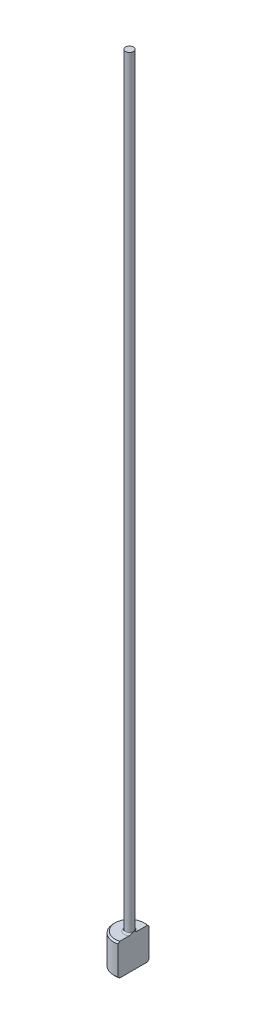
from build123d import *
from build123d.topology import SkipClean

# Parameters (mm, degrees)
CHAMFER1_SIZE    = 0.2
FILLET1_R        = 0.2
KEYED_HEAD_DEPTH = 101.039992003


with BuildPart() as part:
    # Sketch1 → Revolve1 (revolve)
    with BuildSketch(Plane.XY, mode=Mode.PRIVATE) as revolve1_sk:
        Polygon((0, 0), (-2, 0), (-2, 4), (-0.5, 4), (-0.5, 100), (0, 100), align=None)
    revolve(revolve1_sk.sketch.rotate(Axis((0, 259.958771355, 0), (0, -1, 0)), 270), axis=Axis((0, 259.958771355, 0), (0, -1, 0)))

    # Chamfer1
    chamfer1_edges = [part.edges().sort_by_distance(p)[0] for p in [
        (0, 4, -2),
        (0, 0, -2),
    ]]
    chamfer(chamfer1_edges, length=CHAMFER1_SIZE)

    # Fillet1
    fillet1_edges = [part.edges().sort_by_distance(p)[0] for p in [
        (0, 4, -0.5),
    ]]
    fillet(fillet1_edges, radius=FILLET1_R)

    # Sketch2 → KEYED HEAD (cut, through all)
    with SkipClean():  # the faces are left unmerged after this step: merging them gives an invalid solid
        with BuildSketch(Plane(origin=(0, 0, 0), x_dir=(1, 0, 0), z_dir=(0, 1, 0))):
            with BuildLine():
                Line((0.5, -1.936491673), (0.5, 1.936491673))
                ThreePointArc((0.5, 1.936491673), (2, 0), (0.5, -1.936491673))
            make_face()
        extrude(amount=KEYED_HEAD_DEPTH, mode=Mode.SUBTRACT)


solid = part.part
